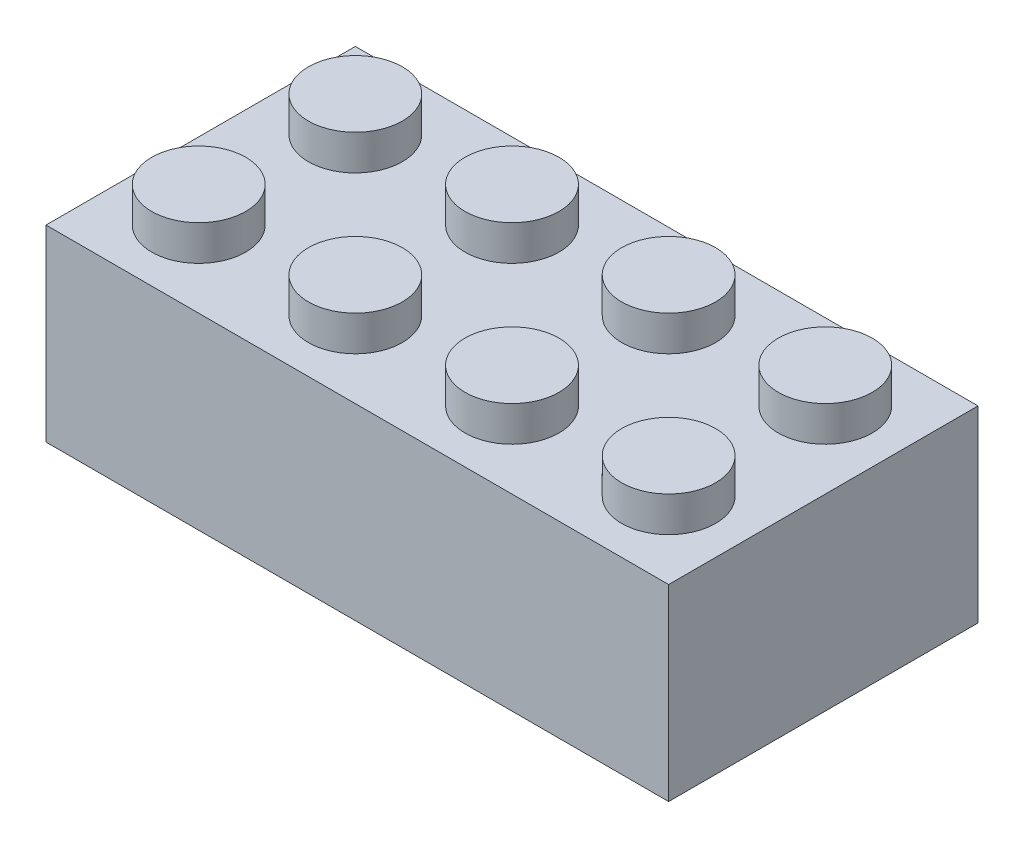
ISO-10303-21;
HEADER;
FILE_DESCRIPTION(('STEP AP214'),'2;1');
FILE_NAME('part.step','',(''),(''),'','','');
FILE_SCHEMA(('AUTOMOTIVE_DESIGN { 1 0 10303 214 1 1 1 1 }'));
ENDSEC;
DATA;
#1=APPLICATION_CONTEXT('core data for automotive mechanical design processes');
#2=APPLICATION_PROTOCOL_DEFINITION('international standard','automotive_design',2000,#1);
#3=PRODUCT_CONTEXT('',#1,'mechanical');
#4=PRODUCT('Part','Part','',(#3));
#5=PRODUCT_RELATED_PRODUCT_CATEGORY('part','',(#4));
#6=PRODUCT_DEFINITION_FORMATION('','',#4);
#7=PRODUCT_DEFINITION_CONTEXT('part definition',#1,'design');
#8=PRODUCT_DEFINITION('design','',#6,#7);
#9=PRODUCT_DEFINITION_SHAPE('','',#8);
#10=(LENGTH_UNIT() NAMED_UNIT(*) SI_UNIT(.MILLI.,.METRE.));
#11=(NAMED_UNIT(*) PLANE_ANGLE_UNIT() SI_UNIT($,.RADIAN.));
#12=(NAMED_UNIT(*) SI_UNIT($,.STERADIAN.) SOLID_ANGLE_UNIT());
#13=UNCERTAINTY_MEASURE_WITH_UNIT(LENGTH_MEASURE(1.E-05),#10,'distance_accuracy_value','');
#14=(GEOMETRIC_REPRESENTATION_CONTEXT(3) GLOBAL_UNCERTAINTY_ASSIGNED_CONTEXT((#13)) GLOBAL_UNIT_ASSIGNED_CONTEXT((#10,
#11,#12)) REPRESENTATION_CONTEXT('',''));
#15=CARTESIAN_POINT('',(0.,0.,0.));
#16=DIRECTION('',(0.,0.,1.));
#17=DIRECTION('',(1.,0.,0.));
#18=AXIS2_PLACEMENT_3D('',#15,#16,#17);
#19=CARTESIAN_POINT('',(0.,0.,15.8));
#20=DIRECTION('',(1.,0.,0.));
#21=DIRECTION('',(0.,0.,-1.));
#22=AXIS2_PLACEMENT_3D('',#19,#20,#21);
#23=PLANE('',#22);
#24=DIRECTION('',(0.,-1.,0.));
#25=VECTOR('',#24,1.);
#26=CARTESIAN_POINT('',(0.,0.,0.));
#27=LINE('',#26,#25);
#28=CARTESIAN_POINT('',(0.,9.6,0.));
#29=VERTEX_POINT('',#28);
#30=CARTESIAN_POINT('',(0.,0.,0.));
#31=VERTEX_POINT('',#30);
#32=EDGE_CURVE('E101',#29,#31,#27,.T.);
#33=ORIENTED_EDGE('',*,*,#32,.T.);
#34=DIRECTION('',(0.,0.,-1.));
#35=VECTOR('',#34,1.);
#36=CARTESIAN_POINT('',(0.,0.,15.8));
#37=LINE('',#36,#35);
#38=CARTESIAN_POINT('',(0.,0.,15.8));
#39=VERTEX_POINT('',#38);
#40=EDGE_CURVE('E92',#39,#31,#37,.T.);
#41=ORIENTED_EDGE('',*,*,#40,.F.);
#42=DIRECTION('',(0.,-1.,0.));
#43=VECTOR('',#42,1.);
#44=CARTESIAN_POINT('',(0.,0.,15.8));
#45=LINE('',#44,#43);
#46=CARTESIAN_POINT('',(0.,9.6,15.8));
#47=VERTEX_POINT('',#46);
#48=EDGE_CURVE('E86',#47,#39,#45,.T.);
#49=ORIENTED_EDGE('',*,*,#48,.F.);
#50=DIRECTION('',(0.,0.,-1.));
#51=VECTOR('',#50,1.);
#52=CARTESIAN_POINT('',(0.,9.6,15.8));
#53=LINE('',#52,#51);
#54=EDGE_CURVE('E97',#47,#29,#53,.T.);
#55=ORIENTED_EDGE('',*,*,#54,.T.);
#56=EDGE_LOOP('',(#33,#41,#49,#55));
#57=FACE_BOUND('',#56,.T.);
#58=ADVANCED_FACE('F34',(#57),#23,.F.);
#59=CARTESIAN_POINT('',(0.,0.,15.8));
#60=DIRECTION('',(0.,1.,0.));
#61=DIRECTION('',(0.,0.,1.));
#62=AXIS2_PLACEMENT_3D('',#59,#60,#61);
#63=PLANE('',#62);
#64=DIRECTION('',(1.,0.,0.));
#65=VECTOR('',#64,1.);
#66=CARTESIAN_POINT('',(0.,0.,0.));
#67=LINE('',#66,#65);
#68=CARTESIAN_POINT('',(31.8,0.,0.));
#69=VERTEX_POINT('',#68);
#70=EDGE_CURVE('E91',#31,#69,#67,.T.);
#71=ORIENTED_EDGE('',*,*,#70,.T.);
#72=DIRECTION('',(0.,0.,-1.));
#73=VECTOR('',#72,1.);
#74=CARTESIAN_POINT('',(31.8,0.,15.8));
#75=LINE('',#74,#73);
#76=CARTESIAN_POINT('',(31.8,0.,15.8));
#77=VERTEX_POINT('',#76);
#78=EDGE_CURVE('E89',#77,#69,#75,.T.);
#79=ORIENTED_EDGE('',*,*,#78,.F.);
#80=DIRECTION('',(1.,0.,0.));
#81=VECTOR('',#80,1.);
#82=CARTESIAN_POINT('',(0.,0.,15.8));
#83=LINE('',#82,#81);
#84=EDGE_CURVE('E81',#39,#77,#83,.T.);
#85=ORIENTED_EDGE('',*,*,#84,.F.);
#86=ORIENTED_EDGE('',*,*,#40,.T.);
#87=EDGE_LOOP('',(#71,#79,#85,#86));
#88=FACE_BOUND('',#87,.T.);
#89=ADVANCED_FACE('F90',(#88),#63,.F.);
#90=CARTESIAN_POINT('',(31.8,0.,15.8));
#91=DIRECTION('',(-1.,0.,0.));
#92=DIRECTION('',(0.,-1.,0.));
#93=AXIS2_PLACEMENT_3D('',#90,#91,#92);
#94=PLANE('',#93);
#95=DIRECTION('',(0.,1.,0.));
#96=VECTOR('',#95,1.);
#97=CARTESIAN_POINT('',(31.8,0.,0.));
#98=LINE('',#97,#96);
#99=CARTESIAN_POINT('',(31.8,9.6,0.));
#100=VERTEX_POINT('',#99);
#101=EDGE_CURVE('E67',#69,#100,#98,.T.);
#102=ORIENTED_EDGE('',*,*,#101,.T.);
#103=DIRECTION('',(0.,0.,-1.));
#104=VECTOR('',#103,1.);
#105=CARTESIAN_POINT('',(31.8,9.6,15.8));
#106=LINE('',#105,#104);
#107=CARTESIAN_POINT('',(31.8,9.6,15.8));
#108=VERTEX_POINT('',#107);
#109=EDGE_CURVE('E93',#108,#100,#106,.T.);
#110=ORIENTED_EDGE('',*,*,#109,.F.);
#111=DIRECTION('',(0.,1.,0.));
#112=VECTOR('',#111,1.);
#113=CARTESIAN_POINT('',(31.8,0.,15.8));
#114=LINE('',#113,#112);
#115=EDGE_CURVE('E84',#77,#108,#114,.T.);
#116=ORIENTED_EDGE('',*,*,#115,.F.);
#117=ORIENTED_EDGE('',*,*,#78,.T.);
#118=EDGE_LOOP('',(#102,#110,#116,#117));
#119=FACE_BOUND('',#118,.T.);
#120=ADVANCED_FACE('F95',(#119),#94,.F.);
#121=CARTESIAN_POINT('',(0.,9.6,15.8));
#122=DIRECTION('',(0.,-1.,0.));
#123=DIRECTION('',(0.,0.,-1.));
#124=AXIS2_PLACEMENT_3D('',#121,#122,#123);
#125=PLANE('',#124);
#126=CARTESIAN_POINT('',(27.9,9.6,3.9));
#127=DIRECTION('',(0.,-1.,0.));
#128=DIRECTION('',(0.,0.,-1.));
#129=AXIS2_PLACEMENT_3D('',#126,#127,#128);
#130=CIRCLE('',#129,2.4);
#131=CARTESIAN_POINT('',(27.9,9.6,1.5));
#132=VERTEX_POINT('',#131);
#133=EDGE_CURVE('E11',#132,#132,#130,.F.);
#134=ORIENTED_EDGE('',*,*,#133,.F.);
#135=EDGE_LOOP('',(#134));
#136=FACE_BOUND('',#135,.T.);
#137=CARTESIAN_POINT('',(19.9,9.6,3.9));
#138=DIRECTION('',(0.,-1.,0.));
#139=DIRECTION('',(0.,0.,-1.));
#140=AXIS2_PLACEMENT_3D('',#137,#138,#139);
#141=CIRCLE('',#140,2.4);
#142=CARTESIAN_POINT('',(19.9,9.6,1.5));
#143=VERTEX_POINT('',#142);
#144=EDGE_CURVE('E42',#143,#143,#141,.F.);
#145=ORIENTED_EDGE('',*,*,#144,.F.);
#146=EDGE_LOOP('',(#145));
#147=FACE_BOUND('',#146,.T.);
#148=CARTESIAN_POINT('',(27.9,9.6,11.9));
#149=DIRECTION('',(0.,-1.,0.));
#150=DIRECTION('',(0.,0.,-1.));
#151=AXIS2_PLACEMENT_3D('',#148,#149,#150);
#152=CIRCLE('',#151,2.4);
#153=CARTESIAN_POINT('',(27.9,9.6,9.5));
#154=VERTEX_POINT('',#153);
#155=EDGE_CURVE('E126',#154,#154,#152,.F.);
#156=ORIENTED_EDGE('',*,*,#155,.F.);
#157=EDGE_LOOP('',(#156));
#158=FACE_BOUND('',#157,.T.);
#159=CARTESIAN_POINT('',(19.9,9.6,11.9));
#160=DIRECTION('',(0.,-1.,0.));
#161=DIRECTION('',(0.,0.,-1.));
#162=AXIS2_PLACEMENT_3D('',#159,#160,#161);
#163=CIRCLE('',#162,2.4);
#164=CARTESIAN_POINT('',(19.9,9.6,9.5));
#165=VERTEX_POINT('',#164);
#166=EDGE_CURVE('E123',#165,#165,#163,.F.);
#167=ORIENTED_EDGE('',*,*,#166,.F.);
#168=EDGE_LOOP('',(#167));
#169=FACE_BOUND('',#168,.T.);
#170=CARTESIAN_POINT('',(3.9,9.6,11.9));
#171=DIRECTION('',(0.,-1.,0.));
#172=DIRECTION('',(0.,0.,-1.));
#173=AXIS2_PLACEMENT_3D('',#170,#171,#172);
#174=CIRCLE('',#173,2.4);
#175=CARTESIAN_POINT('',(3.9,9.6,9.5));
#176=VERTEX_POINT('',#175);
#177=EDGE_CURVE('E120',#176,#176,#174,.F.);
#178=ORIENTED_EDGE('',*,*,#177,.F.);
#179=EDGE_LOOP('',(#178));
#180=FACE_BOUND('',#179,.T.);
#181=CARTESIAN_POINT('',(11.9,9.6,11.9));
#182=DIRECTION('',(0.,-1.,0.));
#183=DIRECTION('',(0.,0.,-1.));
#184=AXIS2_PLACEMENT_3D('',#181,#182,#183);
#185=CIRCLE('',#184,2.4);
#186=CARTESIAN_POINT('',(11.9,9.6,9.5));
#187=VERTEX_POINT('',#186);
#188=EDGE_CURVE('E117',#187,#187,#185,.F.);
#189=ORIENTED_EDGE('',*,*,#188,.F.);
#190=EDGE_LOOP('',(#189));
#191=FACE_BOUND('',#190,.T.);
#192=CARTESIAN_POINT('',(11.9,9.6,3.9));
#193=DIRECTION('',(0.,-1.,0.));
#194=DIRECTION('',(0.,0.,-1.));
#195=AXIS2_PLACEMENT_3D('',#192,#193,#194);
#196=CIRCLE('',#195,2.4);
#197=CARTESIAN_POINT('',(11.9,9.6,1.5));
#198=VERTEX_POINT('',#197);
#199=EDGE_CURVE('E114',#198,#198,#196,.F.);
#200=ORIENTED_EDGE('',*,*,#199,.F.);
#201=EDGE_LOOP('',(#200));
#202=FACE_BOUND('',#201,.T.);
#203=CARTESIAN_POINT('',(3.9,9.6,3.9));
#204=DIRECTION('',(0.,-1.,0.));
#205=DIRECTION('',(0.,0.,-1.));
#206=AXIS2_PLACEMENT_3D('',#203,#204,#205);
#207=CIRCLE('',#206,2.4);
#208=CARTESIAN_POINT('',(3.9,9.6,1.5));
#209=VERTEX_POINT('',#208);
#210=EDGE_CURVE('E111',#209,#209,#207,.F.);
#211=ORIENTED_EDGE('',*,*,#210,.F.);
#212=EDGE_LOOP('',(#211));
#213=FACE_BOUND('',#212,.T.);
#214=DIRECTION('',(-1.,0.,0.));
#215=VECTOR('',#214,1.);
#216=CARTESIAN_POINT('',(0.,9.6,0.));
#217=LINE('',#216,#215);
#218=EDGE_CURVE('E73',#100,#29,#217,.T.);
#219=ORIENTED_EDGE('',*,*,#218,.T.);
#220=ORIENTED_EDGE('',*,*,#54,.F.);
#221=DIRECTION('',(-1.,0.,0.));
#222=VECTOR('',#221,1.);
#223=CARTESIAN_POINT('',(0.,9.6,15.8));
#224=LINE('',#223,#222);
#225=EDGE_CURVE('E50',#108,#47,#224,.T.);
#226=ORIENTED_EDGE('',*,*,#225,.F.);
#227=ORIENTED_EDGE('',*,*,#109,.T.);
#228=EDGE_LOOP('',(#219,#220,#226,#227));
#229=FACE_BOUND('',#228,.T.);
#230=ADVANCED_FACE('F133',(#136,#147,#158,#169,#180,#191,#202,#213,#229),#125,.F.);
#231=CARTESIAN_POINT('',(0.,0.,15.8));
#232=DIRECTION('',(0.,0.,-1.));
#233=DIRECTION('',(-1.,0.,0.));
#234=AXIS2_PLACEMENT_3D('',#231,#232,#233);
#235=PLANE('',#234);
#236=ORIENTED_EDGE('',*,*,#48,.T.);
#237=ORIENTED_EDGE('',*,*,#84,.T.);
#238=ORIENTED_EDGE('',*,*,#115,.T.);
#239=ORIENTED_EDGE('',*,*,#225,.T.);
#240=EDGE_LOOP('',(#236,#237,#238,#239));
#241=FACE_BOUND('',#240,.T.);
#242=ADVANCED_FACE('F82',(#241),#235,.F.);
#243=CARTESIAN_POINT('',(0.,0.,0.));
#244=DIRECTION('',(0.,0.,-1.));
#245=DIRECTION('',(-1.,0.,0.));
#246=AXIS2_PLACEMENT_3D('',#243,#244,#245);
#247=PLANE('',#246);
#248=ORIENTED_EDGE('',*,*,#32,.F.);
#249=ORIENTED_EDGE('',*,*,#218,.F.);
#250=ORIENTED_EDGE('',*,*,#101,.F.);
#251=ORIENTED_EDGE('',*,*,#70,.F.);
#252=EDGE_LOOP('',(#248,#249,#250,#251));
#253=FACE_BOUND('',#252,.T.);
#254=ADVANCED_FACE('F153',(#253),#247,.T.);
#255=CARTESIAN_POINT('',(3.9,11.4,3.9));
#256=DIRECTION('',(0.,-1.,0.));
#257=DIRECTION('',(0.,0.,-1.));
#258=AXIS2_PLACEMENT_3D('',#255,#256,#257);
#259=CYLINDRICAL_SURFACE('',#258,2.4);
#260=CARTESIAN_POINT('',(3.9,11.4,3.9));
#261=DIRECTION('',(0.,1.,0.));
#262=DIRECTION('',(0.,0.,1.));
#263=AXIS2_PLACEMENT_3D('',#260,#261,#262);
#264=CIRCLE('',#263,2.4);
#265=CARTESIAN_POINT('',(3.9,11.4,6.3));
#266=VERTEX_POINT('',#265);
#267=EDGE_CURVE('E104',#266,#266,#264,.T.);
#268=ORIENTED_EDGE('',*,*,#267,.F.);
#269=EDGE_LOOP('',(#268));
#270=FACE_BOUND('',#269,.T.);
#271=ORIENTED_EDGE('',*,*,#210,.T.);
#272=EDGE_LOOP('',(#271));
#273=FACE_BOUND('',#272,.T.);
#274=ADVANCED_FACE('F150',(#270,#273),#259,.T.);
#275=CARTESIAN_POINT('',(3.9,11.4,3.9));
#276=DIRECTION('',(0.,1.,0.));
#277=DIRECTION('',(0.,0.,1.));
#278=AXIS2_PLACEMENT_3D('',#275,#276,#277);
#279=PLANE('',#278);
#280=ORIENTED_EDGE('',*,*,#267,.T.);
#281=EDGE_LOOP('',(#280));
#282=FACE_BOUND('',#281,.T.);
#283=ADVANCED_FACE('F152',(#282),#279,.T.);
#284=CARTESIAN_POINT('',(11.9,11.4,3.9));
#285=DIRECTION('',(0.,-1.,0.));
#286=DIRECTION('',(0.,0.,-1.));
#287=AXIS2_PLACEMENT_3D('',#284,#285,#286);
#288=CYLINDRICAL_SURFACE('',#287,2.4);
#289=CARTESIAN_POINT('',(11.9,11.4,3.9));
#290=DIRECTION('',(0.,1.,0.));
#291=DIRECTION('',(0.,0.,1.));
#292=AXIS2_PLACEMENT_3D('',#289,#290,#291);
#293=CIRCLE('',#292,2.4);
#294=CARTESIAN_POINT('',(11.9,11.4,6.3));
#295=VERTEX_POINT('',#294);
#296=EDGE_CURVE('E176',#295,#295,#293,.T.);
#297=ORIENTED_EDGE('',*,*,#296,.F.);
#298=EDGE_LOOP('',(#297));
#299=FACE_BOUND('',#298,.T.);
#300=ORIENTED_EDGE('',*,*,#199,.T.);
#301=EDGE_LOOP('',(#300));
#302=FACE_BOUND('',#301,.T.);
#303=ADVANCED_FACE('F160',(#299,#302),#288,.T.);
#304=CARTESIAN_POINT('',(11.9,11.4,3.9));
#305=DIRECTION('',(0.,1.,0.));
#306=DIRECTION('',(0.,0.,1.));
#307=AXIS2_PLACEMENT_3D('',#304,#305,#306);
#308=PLANE('',#307);
#309=ORIENTED_EDGE('',*,*,#296,.T.);
#310=EDGE_LOOP('',(#309));
#311=FACE_BOUND('',#310,.T.);
#312=ADVANCED_FACE('F248',(#311),#308,.T.);
#313=CARTESIAN_POINT('',(11.9,11.4,11.9));
#314=DIRECTION('',(0.,-1.,0.));
#315=DIRECTION('',(0.,0.,-1.));
#316=AXIS2_PLACEMENT_3D('',#313,#314,#315);
#317=CYLINDRICAL_SURFACE('',#316,2.4);
#318=CARTESIAN_POINT('',(11.9,11.4,11.9));
#319=DIRECTION('',(0.,1.,0.));
#320=DIRECTION('',(0.,0.,-1.));
#321=AXIS2_PLACEMENT_3D('',#318,#319,#320);
#322=CIRCLE('',#321,2.4);
#323=CARTESIAN_POINT('',(11.9,11.4,9.5));
#324=VERTEX_POINT('',#323);
#325=EDGE_CURVE('E179',#324,#324,#322,.T.);
#326=ORIENTED_EDGE('',*,*,#325,.F.);
#327=EDGE_LOOP('',(#326));
#328=FACE_BOUND('',#327,.T.);
#329=ORIENTED_EDGE('',*,*,#188,.T.);
#330=EDGE_LOOP('',(#329));
#331=FACE_BOUND('',#330,.T.);
#332=ADVANCED_FACE('F244',(#328,#331),#317,.T.);
#333=CARTESIAN_POINT('',(11.9,11.4,11.9));
#334=DIRECTION('',(0.,-1.,0.));
#335=DIRECTION('',(0.,0.,-1.));
#336=AXIS2_PLACEMENT_3D('',#333,#334,#335);
#337=PLANE('',#336);
#338=ORIENTED_EDGE('',*,*,#325,.T.);
#339=EDGE_LOOP('',(#338));
#340=FACE_BOUND('',#339,.T.);
#341=ADVANCED_FACE('F240',(#340),#337,.F.);
#342=CARTESIAN_POINT('',(3.9,11.4,11.9));
#343=DIRECTION('',(0.,-1.,0.));
#344=DIRECTION('',(0.,0.,-1.));
#345=AXIS2_PLACEMENT_3D('',#342,#343,#344);
#346=CYLINDRICAL_SURFACE('',#345,2.4);
#347=CARTESIAN_POINT('',(3.9,11.4,11.9));
#348=DIRECTION('',(0.,1.,0.));
#349=DIRECTION('',(0.,0.,-1.));
#350=AXIS2_PLACEMENT_3D('',#347,#348,#349);
#351=CIRCLE('',#350,2.4);
#352=CARTESIAN_POINT('',(3.9,11.4,9.5));
#353=VERTEX_POINT('',#352);
#354=EDGE_CURVE('E182',#353,#353,#351,.T.);
#355=ORIENTED_EDGE('',*,*,#354,.F.);
#356=EDGE_LOOP('',(#355));
#357=FACE_BOUND('',#356,.T.);
#358=ORIENTED_EDGE('',*,*,#177,.T.);
#359=EDGE_LOOP('',(#358));
#360=FACE_BOUND('',#359,.T.);
#361=ADVANCED_FACE('F236',(#357,#360),#346,.T.);
#362=CARTESIAN_POINT('',(3.9,11.4,11.9));
#363=DIRECTION('',(0.,-1.,0.));
#364=DIRECTION('',(0.,0.,-1.));
#365=AXIS2_PLACEMENT_3D('',#362,#363,#364);
#366=PLANE('',#365);
#367=ORIENTED_EDGE('',*,*,#354,.T.);
#368=EDGE_LOOP('',(#367));
#369=FACE_BOUND('',#368,.T.);
#370=ADVANCED_FACE('F232',(#369),#366,.F.);
#371=CARTESIAN_POINT('',(19.9,11.4,11.9));
#372=DIRECTION('',(0.,-1.,0.));
#373=DIRECTION('',(0.,0.,-1.));
#374=AXIS2_PLACEMENT_3D('',#371,#372,#373);
#375=CYLINDRICAL_SURFACE('',#374,2.4);
#376=CARTESIAN_POINT('',(19.9,11.4,11.9));
#377=DIRECTION('',(0.,1.,0.));
#378=DIRECTION('',(0.,0.,1.));
#379=AXIS2_PLACEMENT_3D('',#376,#377,#378);
#380=CIRCLE('',#379,2.4);
#381=CARTESIAN_POINT('',(19.9,11.4,14.3));
#382=VERTEX_POINT('',#381);
#383=EDGE_CURVE('E185',#382,#382,#380,.T.);
#384=ORIENTED_EDGE('',*,*,#383,.F.);
#385=EDGE_LOOP('',(#384));
#386=FACE_BOUND('',#385,.T.);
#387=ORIENTED_EDGE('',*,*,#166,.T.);
#388=EDGE_LOOP('',(#387));
#389=FACE_BOUND('',#388,.T.);
#390=ADVANCED_FACE('F228',(#386,#389),#375,.T.);
#391=CARTESIAN_POINT('',(19.9,11.4,11.9));
#392=DIRECTION('',(0.,1.,0.));
#393=DIRECTION('',(0.,0.,1.));
#394=AXIS2_PLACEMENT_3D('',#391,#392,#393);
#395=PLANE('',#394);
#396=ORIENTED_EDGE('',*,*,#383,.T.);
#397=EDGE_LOOP('',(#396));
#398=FACE_BOUND('',#397,.T.);
#399=ADVANCED_FACE('F224',(#398),#395,.T.);
#400=CARTESIAN_POINT('',(27.9,11.4,11.9));
#401=DIRECTION('',(0.,-1.,0.));
#402=DIRECTION('',(0.,0.,-1.));
#403=AXIS2_PLACEMENT_3D('',#400,#401,#402);
#404=CYLINDRICAL_SURFACE('',#403,2.4);
#405=CARTESIAN_POINT('',(27.9,11.4,11.9));
#406=DIRECTION('',(0.,1.,0.));
#407=DIRECTION('',(0.,0.,1.));
#408=AXIS2_PLACEMENT_3D('',#405,#406,#407);
#409=CIRCLE('',#408,2.4);
#410=CARTESIAN_POINT('',(27.9,11.4,14.3));
#411=VERTEX_POINT('',#410);
#412=EDGE_CURVE('E188',#411,#411,#409,.T.);
#413=ORIENTED_EDGE('',*,*,#412,.F.);
#414=EDGE_LOOP('',(#413));
#415=FACE_BOUND('',#414,.T.);
#416=ORIENTED_EDGE('',*,*,#155,.T.);
#417=EDGE_LOOP('',(#416));
#418=FACE_BOUND('',#417,.T.);
#419=ADVANCED_FACE('F220',(#415,#418),#404,.T.);
#420=CARTESIAN_POINT('',(27.9,11.4,11.9));
#421=DIRECTION('',(0.,1.,0.));
#422=DIRECTION('',(0.,0.,1.));
#423=AXIS2_PLACEMENT_3D('',#420,#421,#422);
#424=PLANE('',#423);
#425=ORIENTED_EDGE('',*,*,#412,.T.);
#426=EDGE_LOOP('',(#425));
#427=FACE_BOUND('',#426,.T.);
#428=ADVANCED_FACE('F216',(#427),#424,.T.);
#429=CARTESIAN_POINT('',(19.9,11.4,3.9));
#430=DIRECTION('',(0.,-1.,0.));
#431=DIRECTION('',(0.,0.,-1.));
#432=AXIS2_PLACEMENT_3D('',#429,#430,#431);
#433=CYLINDRICAL_SURFACE('',#432,2.4);
#434=CARTESIAN_POINT('',(19.9,11.4,3.9));
#435=DIRECTION('',(0.,1.,0.));
#436=DIRECTION('',(0.,0.,-1.));
#437=AXIS2_PLACEMENT_3D('',#434,#435,#436);
#438=CIRCLE('',#437,2.4);
#439=CARTESIAN_POINT('',(19.9,11.4,1.5));
#440=VERTEX_POINT('',#439);
#441=EDGE_CURVE('E191',#440,#440,#438,.T.);
#442=ORIENTED_EDGE('',*,*,#441,.F.);
#443=EDGE_LOOP('',(#442));
#444=FACE_BOUND('',#443,.T.);
#445=ORIENTED_EDGE('',*,*,#144,.T.);
#446=EDGE_LOOP('',(#445));
#447=FACE_BOUND('',#446,.T.);
#448=ADVANCED_FACE('F131',(#444,#447),#433,.T.);
#449=CARTESIAN_POINT('',(19.9,11.4,3.9));
#450=DIRECTION('',(0.,-1.,0.));
#451=DIRECTION('',(0.,0.,-1.));
#452=AXIS2_PLACEMENT_3D('',#449,#450,#451);
#453=PLANE('',#452);
#454=ORIENTED_EDGE('',*,*,#441,.T.);
#455=EDGE_LOOP('',(#454));
#456=FACE_BOUND('',#455,.T.);
#457=ADVANCED_FACE('F203',(#456),#453,.F.);
#458=CARTESIAN_POINT('',(27.9,11.4,3.9));
#459=DIRECTION('',(0.,-1.,0.));
#460=DIRECTION('',(0.,0.,-1.));
#461=AXIS2_PLACEMENT_3D('',#458,#459,#460);
#462=CYLINDRICAL_SURFACE('',#461,2.4);
#463=CARTESIAN_POINT('',(27.9,11.4,3.9));
#464=DIRECTION('',(0.,1.,0.));
#465=DIRECTION('',(0.,0.,-1.));
#466=AXIS2_PLACEMENT_3D('',#463,#464,#465);
#467=CIRCLE('',#466,2.4);
#468=CARTESIAN_POINT('',(27.9,11.4,1.5));
#469=VERTEX_POINT('',#468);
#470=EDGE_CURVE('E194',#469,#469,#467,.T.);
#471=ORIENTED_EDGE('',*,*,#470,.F.);
#472=EDGE_LOOP('',(#471));
#473=FACE_BOUND('',#472,.T.);
#474=ORIENTED_EDGE('',*,*,#133,.T.);
#475=EDGE_LOOP('',(#474));
#476=FACE_BOUND('',#475,.T.);
#477=ADVANCED_FACE('F200',(#473,#476),#462,.T.);
#478=CARTESIAN_POINT('',(27.9,11.4,3.9));
#479=DIRECTION('',(0.,-1.,0.));
#480=DIRECTION('',(0.,0.,-1.));
#481=AXIS2_PLACEMENT_3D('',#478,#479,#480);
#482=PLANE('',#481);
#483=ORIENTED_EDGE('',*,*,#470,.T.);
#484=EDGE_LOOP('',(#483));
#485=FACE_BOUND('',#484,.T.);
#486=ADVANCED_FACE('F198',(#485),#482,.F.);
#487=CLOSED_SHELL('',(#58,#89,#120,#230,#242,#254,#274,#283,#303,#312,#332,#341,#361,#370,#390,
#399,#419,#428,#448,#457,#477,#486));
#488=MANIFOLD_SOLID_BREP('B2',#487);
#489=ADVANCED_BREP_SHAPE_REPRESENTATION('',(#18,#488),#14);
#490=SHAPE_DEFINITION_REPRESENTATION(#9,#489);
ENDSEC;
END-ISO-10303-21;
